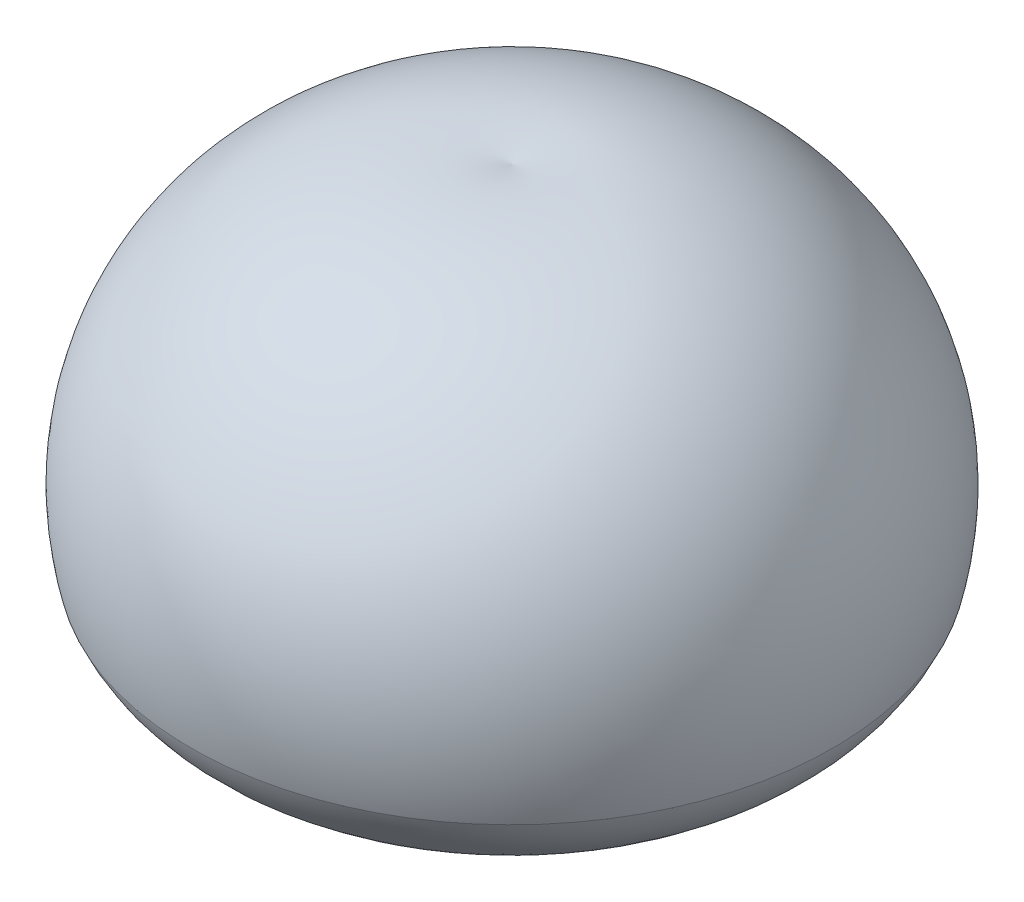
ISO-10303-21;
HEADER;
FILE_DESCRIPTION(('STEP AP214'),'2;1');
FILE_NAME('part.step','',(''),(''),'','','');
FILE_SCHEMA(('AUTOMOTIVE_DESIGN { 1 0 10303 214 1 1 1 1 }'));
ENDSEC;
DATA;
#1=APPLICATION_CONTEXT('core data for automotive mechanical design processes');
#2=APPLICATION_PROTOCOL_DEFINITION('international standard','automotive_design',2000,#1);
#3=PRODUCT_CONTEXT('',#1,'mechanical');
#4=PRODUCT('Part','Part','',(#3));
#5=PRODUCT_RELATED_PRODUCT_CATEGORY('part','',(#4));
#6=PRODUCT_DEFINITION_FORMATION('','',#4);
#7=PRODUCT_DEFINITION_CONTEXT('part definition',#1,'design');
#8=PRODUCT_DEFINITION('design','',#6,#7);
#9=PRODUCT_DEFINITION_SHAPE('','',#8);
#10=(LENGTH_UNIT() NAMED_UNIT(*) SI_UNIT(.MILLI.,.METRE.));
#11=(NAMED_UNIT(*) PLANE_ANGLE_UNIT() SI_UNIT($,.RADIAN.));
#12=(NAMED_UNIT(*) SI_UNIT($,.STERADIAN.) SOLID_ANGLE_UNIT());
#13=UNCERTAINTY_MEASURE_WITH_UNIT(LENGTH_MEASURE(1.E-05),#10,'distance_accuracy_value','');
#14=(GEOMETRIC_REPRESENTATION_CONTEXT(3) GLOBAL_UNCERTAINTY_ASSIGNED_CONTEXT((#13)) GLOBAL_UNIT_ASSIGNED_CONTEXT((#10,
#11,#12)) REPRESENTATION_CONTEXT('',''));
#15=CARTESIAN_POINT('',(0.,0.,0.));
#16=DIRECTION('',(0.,0.,1.));
#17=DIRECTION('',(1.,0.,0.));
#18=AXIS2_PLACEMENT_3D('',#15,#16,#17);
#19=CARTESIAN_POINT('',(0.,1134.11237799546,734.962845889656));
#20=DIRECTION('',(-1.,0.,0.));
#21=DIRECTION('',(0.,0.,-1.));
#22=AXIS2_PLACEMENT_3D('',#19,#20,#21);
#23=CIRCLE('',#22,1191.52213575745);
#24=TRIMMED_CURVE('',#23,(PARAMETER_VALUE(-0.906091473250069)),
(PARAMETER_VALUE(0.906091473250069)),.T.,.PARAMETER.);
#25=CARTESIAN_POINT('',(0.,1134.11237799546,0.));
#26=DIRECTION('',(0.,-1.,0.));
#27=AXIS1_PLACEMENT('',#25,#26);
#28=SURFACE_OF_REVOLUTION('',#24,#27);
#29=CARTESIAN_POINT('',(0.,2071.95810899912,0.));
#30=VERTEX_POINT('',#29);
#31=VERTEX_LOOP('',#30);
#32=FACE_BOUND('',#31,.T.);
#33=CARTESIAN_POINT('',(0.,1464.7696824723,0.));
#34=DIRECTION('',(0.,-1.,0.));
#35=DIRECTION('',(0.,0.,-1.));
#36=AXIS2_PLACEMENT_3D('',#33,#34,#35);
#37=CIRCLE('',#36,409.760154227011);
#38=CARTESIAN_POINT('',(0.,1464.7696824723,-409.760154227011));
#39=VERTEX_POINT('',#38);
#40=EDGE_CURVE('E34',#39,#39,#37,.T.);
#41=ORIENTED_EDGE('',*,*,#40,.T.);
#42=EDGE_LOOP('',(#41));
#43=FACE_BOUND('',#42,.T.);
#44=ADVANCED_FACE('F16',(#32,#43),#28,.F.);
#45=CARTESIAN_POINT('',(0.,830.,-400.));
#46=DIRECTION('',(-1.,0.,0.));
#47=DIRECTION('',(0.,0.,-1.));
#48=AXIS2_PLACEMENT_3D('',#45,#46,#47);
#49=CIRCLE('',#48,2337.74700282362);
#50=TRIMMED_CURVE('',#49,(PARAMETER_VALUE(-1.74274733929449)),
(PARAMETER_VALUE(1.74274733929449)),.T.,.PARAMETER.);
#51=CARTESIAN_POINT('',(0.,830.,0.));
#52=DIRECTION('',(0.,-1.,0.));
#53=AXIS1_PLACEMENT('',#51,#52);
#54=SURFACE_OF_REVOLUTION('',#50,#53);
#55=CARTESIAN_POINT('',(0.,264.163464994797,0.));
#56=DIRECTION('',(0.,-1.,0.));
#57=DIRECTION('',(0.,0.,-1.));
#58=AXIS2_PLACEMENT_3D('',#55,#56,#57);
#59=CIRCLE('',#58,2668.23501094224);
#60=CARTESIAN_POINT('',(0.,264.163464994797,-2668.23501094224));
#61=VERTEX_POINT('',#60);
#62=EDGE_CURVE('E10',#61,#61,#59,.T.);
#63=ORIENTED_EDGE('',*,*,#62,.F.);
#64=EDGE_LOOP('',(#63));
#65=FACE_BOUND('',#64,.T.);
#66=CARTESIAN_POINT('',(0.,3133.27181400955,0.));
#67=VERTEX_POINT('',#66);
#68=VERTEX_LOOP('',#67);
#69=FACE_BOUND('',#68,.T.);
#70=ADVANCED_FACE('F31',(#65,#69),#54,.T.);
#71=CARTESIAN_POINT('',(0.,727.592002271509,0.));
#72=DIRECTION('',(0.,-1.,0.));
#73=DIRECTION('',(0.,0.,-1.));
#74=AXIS2_PLACEMENT_3D('',#71,#72,#73);
#75=TOROIDAL_SURFACE('',#74,1570.5287702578,1191.52213575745);
#76=CARTESIAN_POINT('',(0.,8.66478058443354,0.));
#77=DIRECTION('',(0.,-1.,0.));
#78=DIRECTION('',(0.,0.,-1.));
#79=AXIS2_PLACEMENT_3D('',#76,#77,#78);
#80=CIRCLE('',#79,620.334763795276);
#81=CARTESIAN_POINT('',(0.,8.66478058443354,-620.334763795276));
#82=VERTEX_POINT('',#81);
#83=EDGE_CURVE('E23',#82,#82,#80,.T.);
#84=ORIENTED_EDGE('',*,*,#83,.F.);
#85=EDGE_LOOP('',(#84));
#86=FACE_BOUND('',#85,.T.);
#87=ORIENTED_EDGE('',*,*,#62,.T.);
#88=EDGE_LOOP('',(#87));
#89=FACE_BOUND('',#88,.T.);
#90=ADVANCED_FACE('F45',(#86,#89),#75,.T.);
#91=CARTESIAN_POINT('',(0.,0.,0.));
#92=DIRECTION('',(0.,-1.,0.));
#93=DIRECTION('',(0.,0.,-1.));
#94=AXIS2_PLACEMENT_3D('',#91,#92,#93);
#95=CYLINDRICAL_SURFACE('',#94,620.334763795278);
#96=CARTESIAN_POINT('',(0.,234.617432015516,0.));
#97=DIRECTION('',(0.,-1.,0.));
#98=DIRECTION('',(0.,0.,-1.));
#99=AXIS2_PLACEMENT_3D('',#96,#97,#98);
#100=CIRCLE('',#99,620.334763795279);
#101=CARTESIAN_POINT('',(0.,234.617432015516,-620.334763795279));
#102=VERTEX_POINT('',#101);
#103=EDGE_CURVE('E36',#102,#102,#100,.T.);
#104=ORIENTED_EDGE('',*,*,#103,.F.);
#105=EDGE_LOOP('',(#104));
#106=FACE_BOUND('',#105,.T.);
#107=ORIENTED_EDGE('',*,*,#83,.T.);
#108=EDGE_LOOP('',(#107));
#109=FACE_BOUND('',#108,.T.);
#110=ADVANCED_FACE('F43',(#106,#109),#95,.F.);
#111=CARTESIAN_POINT('',(0.,830.,0.));
#112=DIRECTION('',(0.,-1.,0.));
#113=DIRECTION('',(0.,0.,-1.));
#114=AXIS2_PLACEMENT_3D('',#111,#112,#113);
#115=DEGENERATE_TOROIDAL_SURFACE('',#114,400.,634.84471360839,.T.);
#116=ORIENTED_EDGE('',*,*,#40,.F.);
#117=EDGE_LOOP('',(#116));
#118=FACE_BOUND('',#117,.T.);
#119=ORIENTED_EDGE('',*,*,#103,.T.);
#120=EDGE_LOOP('',(#119));
#121=FACE_BOUND('',#120,.T.);
#122=ADVANCED_FACE('F59',(#118,#121),#115,.F.);
#123=CLOSED_SHELL('',(#44,#70,#90,#110,#122));
#124=MANIFOLD_SOLID_BREP('B1',#123);
#125=ADVANCED_BREP_SHAPE_REPRESENTATION('',(#18,#124),#14);
#126=SHAPE_DEFINITION_REPRESENTATION(#9,#125);
ENDSEC;
END-ISO-10303-21;
